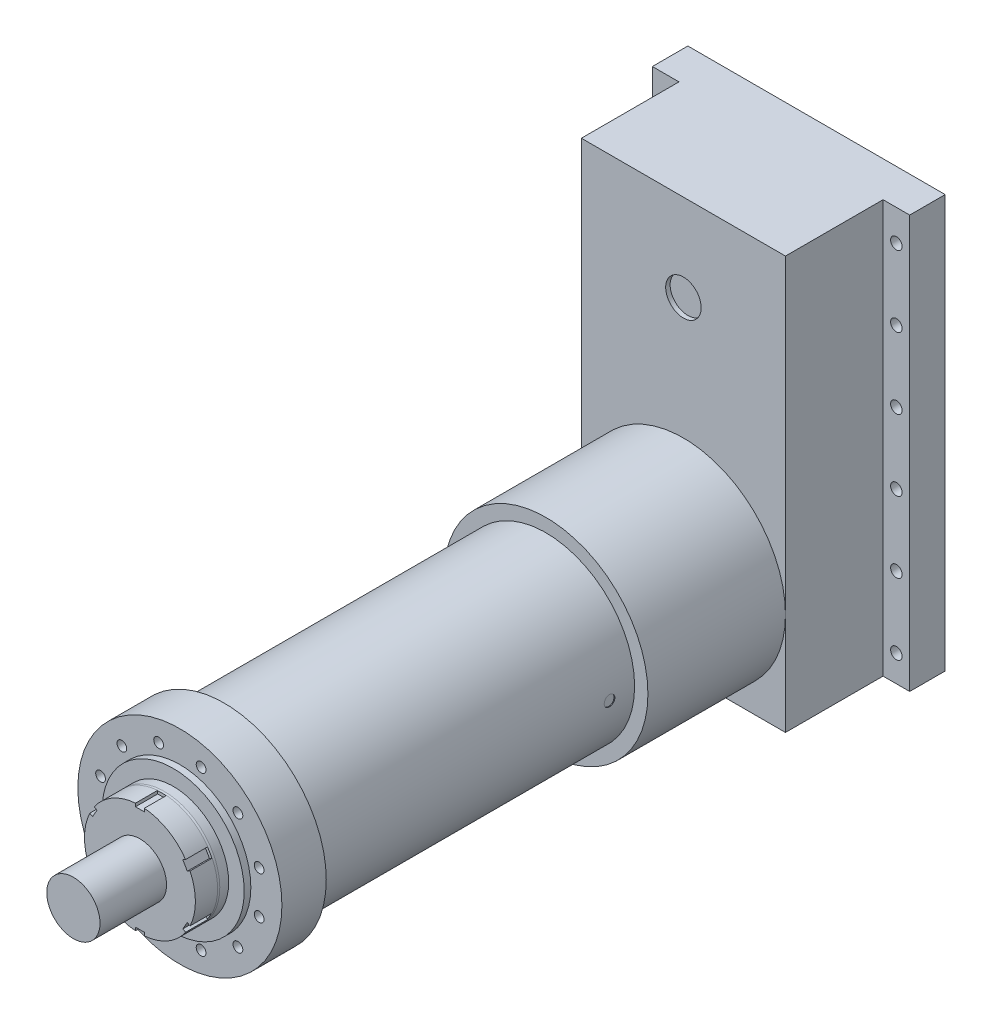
from build123d import *

# Parameters (mm, degrees)
SKETCH_1_R          = 200
EXTRUDE_1_DEPTH     = 725
SKETCH_2_R          = 230
SKETCH_2_R_2        = 11
EXTRUDE_2_DEPTH     = 100
SKETCH_3_R          = 160
EXTRUDE_3_DEPTH     = 15
SKETCH_4_R          = 125
EXTRUDE_4_DEPTH     = 25
CHAMFER_1_SIZE      = 5
CHAMFER_1_SIZE2     = 0.881634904
EXTRUDE_START       = 310
SKETCH_6_R          = 230
EXTRUDE_6_DEPTH     = 310
SKETCH_9_R          = 12
CUT_EXTRUDE_2_DEPTH = 2
SKETCH_10_R         = 12
CUT_EXTRUDE_3_DEPTH = 2
EXTRUDE_7_DEPTH     = 50
SKETCH_11_R         = 60
EXTRUDE_8_DEPTH     = 150
SKETCH_12_W         = 460
SKETCH_12_H         = 930
EXTRUDE_9_DEPTH     = 220
SKETCH_13_R         = 40
CUT_EXTRUDE_4_DEPTH = 10
SKETCH_14_W         = 580
SKETCH_14_H         = 930
SKETCH_14_R         = 13
EXTRUDE_11_DEPTH    = 80


with BuildPart() as part:
    # Sketch 1 → Extrude 1 (new body)
    with BuildSketch(Plane.XY):
        Circle(SKETCH_1_R)
    extrude(amount=EXTRUDE_1_DEPTH)

    # Sketch 2 → Extrude 2 (add)
    with BuildSketch(Plane.XY.offset(725)):
        Circle(SKETCH_2_R)
        with Locations((178.696277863, 47.881523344)):
            Circle(SKETCH_2_R_2, mode=Mode.SUBTRACT)
        with Locations((178.696277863, -47.881523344)):
            Circle(SKETCH_2_R_2, mode=Mode.SUBTRACT)
        with Locations((130.81475452, -130.81475452)):
            Circle(SKETCH_2_R_2, mode=Mode.SUBTRACT)
        with Locations((47.881523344, -178.696277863)):
            Circle(SKETCH_2_R_2, mode=Mode.SUBTRACT)
        with Locations((-47.881523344, -178.696277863)):
            Circle(SKETCH_2_R_2, mode=Mode.SUBTRACT)
        with Locations((-130.81475452, -130.81475452)):
            Circle(SKETCH_2_R_2, mode=Mode.SUBTRACT)
        with Locations((-178.696277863, -47.881523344)):
            Circle(SKETCH_2_R_2, mode=Mode.SUBTRACT)
        with Locations((-178.696277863, 47.881523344)):
            Circle(SKETCH_2_R_2, mode=Mode.SUBTRACT)
        with Locations((-130.81475452, 130.814754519)):
            Circle(SKETCH_2_R_2, mode=Mode.SUBTRACT)
        with Locations((-47.881523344, 178.696277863)):
            Circle(SKETCH_2_R_2, mode=Mode.SUBTRACT)
        with Locations((47.881523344, 178.696277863)):
            Circle(SKETCH_2_R_2, mode=Mode.SUBTRACT)
        with Locations((130.81475452, 130.81475452)):
            Circle(SKETCH_2_R_2, mode=Mode.SUBTRACT)
    extrude(amount=EXTRUDE_2_DEPTH)

    # Sketch 3 → Extrude 3 (add)
    with BuildSketch(Plane.XY.offset(825)):
        Circle(SKETCH_3_R)
    extrude(amount=EXTRUDE_3_DEPTH)

    # Sketch 4 → Extrude 4 (add)
    with BuildSketch(Plane.XY.offset(840)):
        Circle(SKETCH_4_R)
    extrude(amount=EXTRUDE_4_DEPTH)

    # Chamfer 1
    chamfer_1_edges = [part.edges().sort_by_distance(p)[0] for p in [
        (-125, 0, 865),
    ]]
    chamfer_1_side = [part.faces().sort_by_distance(p)[0] for p in [
        (-125, 0, 852.5),
    ]]
    chamfer(chamfer_1_edges, length=CHAMFER_1_SIZE, length2=CHAMFER_1_SIZE2, reference=chamfer_1_side[0])

    # Sketch 6 → Extrude 6 (add)
    with BuildSketch(Plane(origin=(0, 0, 0), x_dir=(-1, 0, 0), z_dir=(0, 0, -1)).offset(EXTRUDE_START)):
        with Locations(Location((0, 0, 0), (0, 0, 180))):
            Circle(SKETCH_6_R)
    extrude(amount=-EXTRUDE_6_DEPTH)

    # Sketch 9 → Cut-Extrude 2 (cut)
    with BuildSketch(Plane(origin=(-200, 0, 0), x_dir=(0, 0, -1), z_dir=(1, 0, 0))):
        with Locations(Location((-36.5, 0, 0), (0, 0, 180))):
            Circle(SKETCH_9_R)
        with Locations(Location((-670.5, 0, 0), (0, 0, 180))):
            Circle(SKETCH_9_R)
    extrude(amount=CUT_EXTRUDE_2_DEPTH, mode=Mode.SUBTRACT)

    # Sketch 10 → Cut-Extrude 3 (cut)
    with BuildSketch(Plane(origin=(200, 0, 0), x_dir=(0, 0, -1), z_dir=(1, 0, 0))):
        with Locations((-56.5, 0)):
            Circle(SKETCH_10_R)
    extrude(amount=-CUT_EXTRUDE_3_DEPTH, mode=Mode.SUBTRACT)

    # Sketch 5 → Extrude 7 (add)
    with BuildSketch(Plane.XY.offset(865)):
        with BuildLine():
            Line((-10, 124.599357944), (-10, 117.5))
            Line((-10, 117.5), (10, 117.5))
            Line((10, 117.5), (10, 124.599357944))
            ThreePointArc((10, 124.599357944), (62.5, 108.253175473), (102.906209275, 70.95993301))
            Line((102.906209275, 70.95993301), (96.757984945, 67.410254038))
            Line((96.757984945, 67.410254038), (106.757984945, 50.089745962))
            Line((106.757984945, 50.089745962), (112.906209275, 53.639424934))
            ThreePointArc((112.906209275, 53.639424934), (125, 0), (112.906209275, -53.639424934))
            Line((112.906209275, -53.639424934), (106.757984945, -50.089745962))
            Line((106.757984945, -50.089745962), (96.757984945, -67.410254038))
            Line((96.757984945, -67.410254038), (102.906209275, -70.95993301))
            ThreePointArc((102.906209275, -70.95993301), (62.5, -108.253175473), (10, -124.599357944))
            Line((10, -124.599357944), (10, -117.5))
            Line((10, -117.5), (-10, -117.5))
            Line((-10, -117.5), (-10, -124.599357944))
            ThreePointArc((-10, -124.599357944), (-62.5, -108.253175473), (-102.906209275, -70.95993301))
            Line((-102.906209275, -70.95993301), (-96.757984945, -67.410254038))
            Line((-96.757984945, -67.410254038), (-106.757984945, -50.089745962))
            Line((-106.757984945, -50.089745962), (-112.906209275, -53.639424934))
            ThreePointArc((-112.906209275, -53.639424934), (-125, 0), (-112.906209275, 53.639424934))
            Line((-112.906209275, 53.639424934), (-106.757984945, 50.089745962))
            Line((-106.757984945, 50.089745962), (-96.757984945, 67.410254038))
            Line((-96.757984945, 67.410254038), (-102.906209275, 70.95993301))
            ThreePointArc((-102.906209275, 70.95993301), (-62.5, 108.253175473), (-10, 124.599357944))
        make_face()
    extrude(amount=EXTRUDE_7_DEPTH)

    # Sketch 11 → Extrude 8 (add)
    with BuildSketch(Plane.XY.offset(915)):
        Circle(SKETCH_11_R)
    extrude(amount=EXTRUDE_8_DEPTH)

    # Sketch 12 → Extrude 9 (add)
    with BuildSketch(Plane(origin=(0, 0, -310), x_dir=(-1, 0, 0), z_dir=(0, 0, -1))):
        with Locations((0, 235)):
            Rectangle(SKETCH_12_W, SKETCH_12_H)
    extrude(amount=EXTRUDE_9_DEPTH)

    # Sketch 13 → Cut-Extrude 4 (cut)
    with BuildSketch(Plane.XY.offset(-310)):
        with Locations((0, 504)):
            Circle(SKETCH_13_R)
    extrude(amount=-CUT_EXTRUDE_4_DEPTH, mode=Mode.SUBTRACT)

    # Sketch 14 → Extrude 11 (add)
    with BuildSketch(Plane(origin=(0, 0, -530), x_dir=(-1, 0, 0), z_dir=(0, 0, -1))):
        with Locations((0, 235)):
            Rectangle(SKETCH_14_W, SKETCH_14_H)
        with Locations((-260, 630)):
            Circle(SKETCH_14_R, mode=Mode.SUBTRACT)
        with Locations((-260, 470)):
            Circle(SKETCH_14_R, mode=Mode.SUBTRACT)
        with Locations((-260, 310)):
            Circle(SKETCH_14_R, mode=Mode.SUBTRACT)
        with Locations((-260, 150)):
            Circle(SKETCH_14_R, mode=Mode.SUBTRACT)
        with Locations((-260, -10)):
            Circle(SKETCH_14_R, mode=Mode.SUBTRACT)
        with Locations((-260, -170)):
            Circle(SKETCH_14_R, mode=Mode.SUBTRACT)
        with Locations(Location((260, -170, 0), (0, 0, 180))):
            Circle(SKETCH_14_R, mode=Mode.SUBTRACT)
        with Locations(Location((260, -10, 0), (0, 0, 180))):
            Circle(SKETCH_14_R, mode=Mode.SUBTRACT)
        with Locations(Location((260, 150, 0), (0, 0, 180))):
            Circle(SKETCH_14_R, mode=Mode.SUBTRACT)
        with Locations(Location((260, 310, 0), (0, 0, 180))):
            Circle(SKETCH_14_R, mode=Mode.SUBTRACT)
        with Locations(Location((260, 470, 0), (0, 0, 180))):
            Circle(SKETCH_14_R, mode=Mode.SUBTRACT)
        with Locations(Location((260, 630, 0), (0, 0, 180))):
            Circle(SKETCH_14_R, mode=Mode.SUBTRACT)
    extrude(amount=EXTRUDE_11_DEPTH)


solid = part.part
